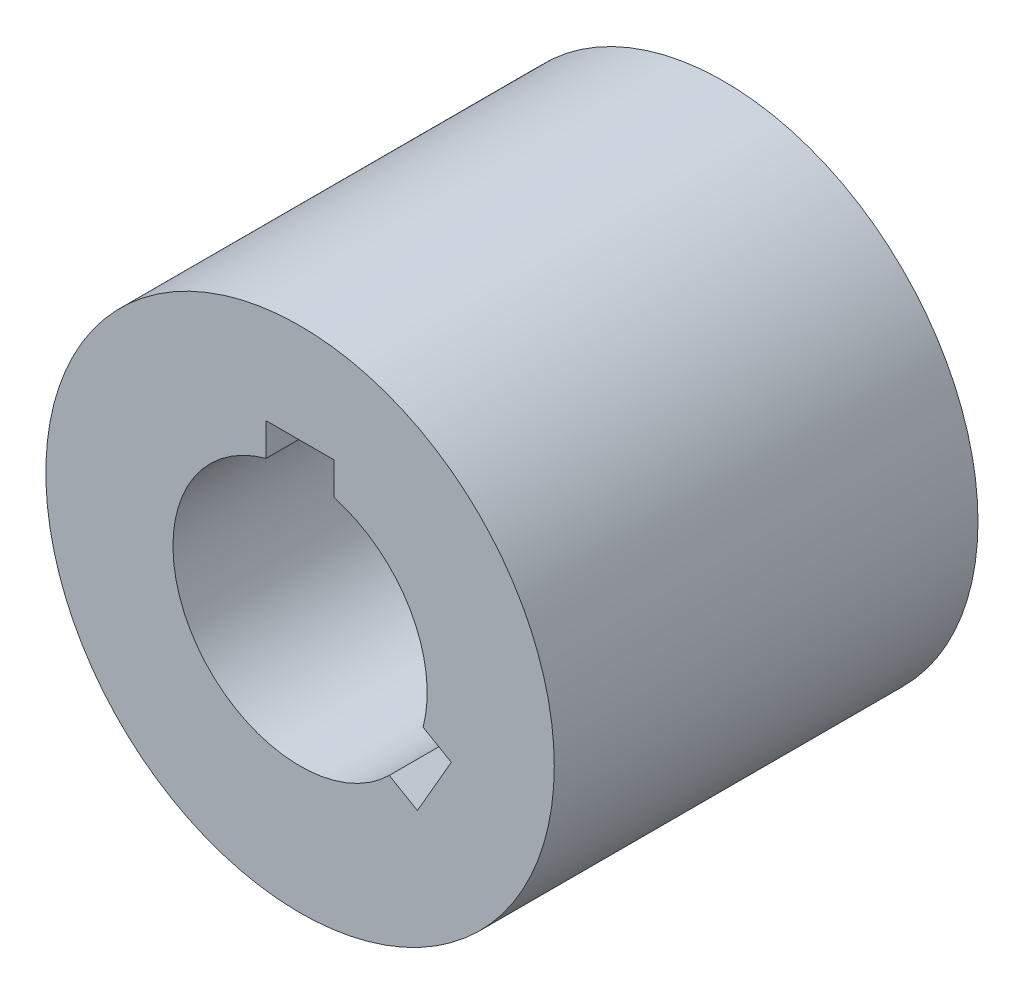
from build123d import *

# Parameters (mm, degrees)
ESQUISSE1_R          = 30
BASE_EXTRUSION_DEPTH = 50


with BuildPart() as part:
    # Esquisse1 → Base-Extrusion (new body)
    with BuildSketch(Plane.XY):
        Circle(ESQUISSE1_R)
        with BuildLine():
            Line((-4, 18.3), (4, 18.3))
            Line((4, 18.3), (4, 14.456832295))
            ThreePointArc((4, 14.456832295), (12.990381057, 7.5), (14.519984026, -3.764314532))
            Line((14.519984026, -3.764314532), (17.848264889, -5.685898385))
            Line((17.848264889, -5.685898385), (13.848264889, -12.614101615))
            Line((13.848264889, -12.614101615), (10.519984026, -10.692517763))
            ThreePointArc((10.519984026, -10.692517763), (-12.990381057, -7.5), (-4, 14.456832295))
            Line((-4, 14.456832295), (-4, 18.3))
        make_face(mode=Mode.SUBTRACT)
    extrude(amount=BASE_EXTRUSION_DEPTH)


solid = part.part
